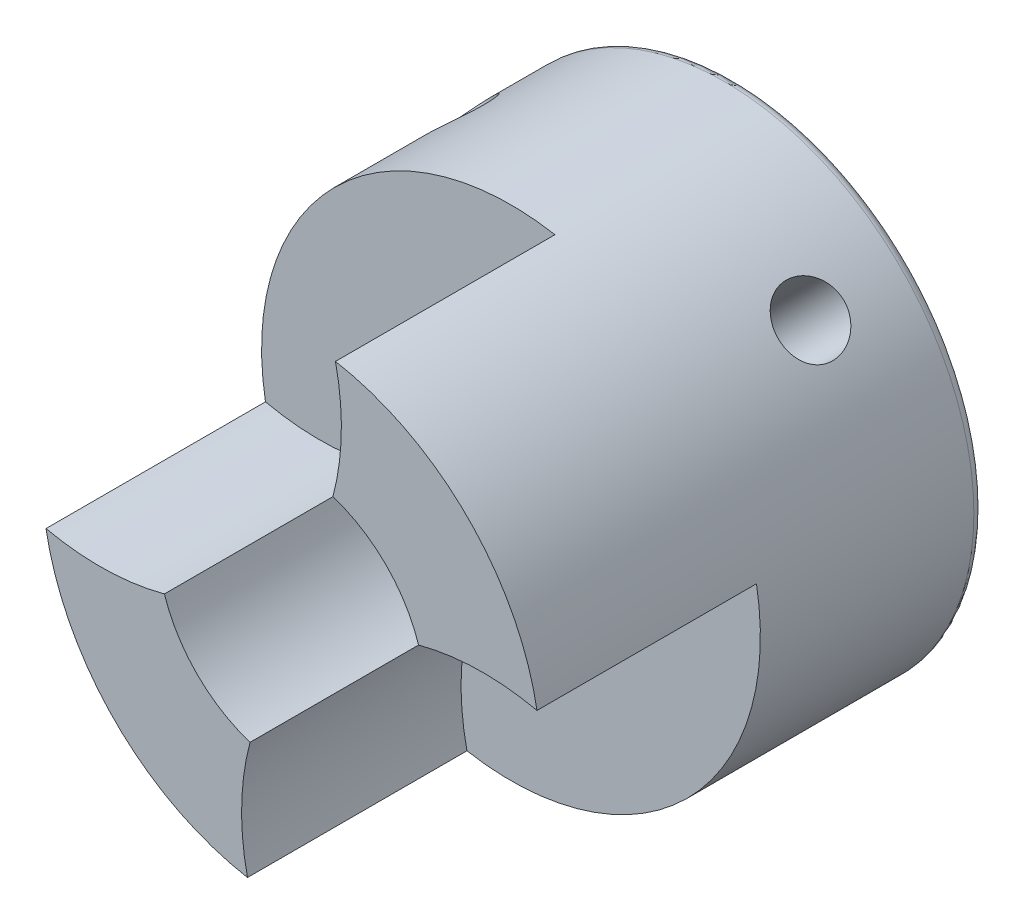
ISO-10303-21;
HEADER;
FILE_DESCRIPTION(('STEP AP214'),'2;1');
FILE_NAME('part.step','',(''),(''),'','','');
FILE_SCHEMA(('AUTOMOTIVE_DESIGN { 1 0 10303 214 1 1 1 1 }'));
ENDSEC;
DATA;
#1=APPLICATION_CONTEXT('core data for automotive mechanical design processes');
#2=APPLICATION_PROTOCOL_DEFINITION('international standard','automotive_design',2000,#1);
#3=PRODUCT_CONTEXT('',#1,'mechanical');
#4=PRODUCT('Part','Part','',(#3));
#5=PRODUCT_RELATED_PRODUCT_CATEGORY('part','',(#4));
#6=PRODUCT_DEFINITION_FORMATION('','',#4);
#7=PRODUCT_DEFINITION_CONTEXT('part definition',#1,'design');
#8=PRODUCT_DEFINITION('design','',#6,#7);
#9=PRODUCT_DEFINITION_SHAPE('','',#8);
#10=(LENGTH_UNIT() NAMED_UNIT(*) SI_UNIT(.MILLI.,.METRE.));
#11=(NAMED_UNIT(*) PLANE_ANGLE_UNIT() SI_UNIT($,.RADIAN.));
#12=(NAMED_UNIT(*) SI_UNIT($,.STERADIAN.) SOLID_ANGLE_UNIT());
#13=UNCERTAINTY_MEASURE_WITH_UNIT(LENGTH_MEASURE(1.E-05),#10,'distance_accuracy_value','');
#14=(GEOMETRIC_REPRESENTATION_CONTEXT(3) GLOBAL_UNCERTAINTY_ASSIGNED_CONTEXT((#13)) GLOBAL_UNIT_ASSIGNED_CONTEXT((#10,
#11,#12)) REPRESENTATION_CONTEXT('',''));
#15=CARTESIAN_POINT('',(0.,0.,0.));
#16=DIRECTION('',(0.,0.,1.));
#17=DIRECTION('',(1.,0.,0.));
#18=AXIS2_PLACEMENT_3D('',#15,#16,#17);
#19=CARTESIAN_POINT('',(0.,0.,22.2));
#20=DIRECTION('',(0.,0.,1.));
#21=DIRECTION('',(1.,0.,0.));
#22=AXIS2_PLACEMENT_3D('',#19,#20,#21);
#23=PLANE('',#22);
#24=CARTESIAN_POINT('',(9.6,-10.,22.2));
#25=DIRECTION('',(0.,0.,1.));
#26=DIRECTION('',(1.,0.,0.));
#27=AXIS2_PLACEMENT_3D('',#24,#25,#26);
#28=CIRCLE('',#27,12.5);
#29=CARTESIAN_POINT('',(12.3041620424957,2.20399556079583,22.2));
#30=VERTEX_POINT('',#29);
#31=CARTESIAN_POINT('',(6.37039730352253,2.0755814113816,22.2));
#32=VERTEX_POINT('',#31);
#33=EDGE_CURVE('E89',#30,#32,#28,.T.);
#34=ORIENTED_EDGE('',*,*,#33,.F.);
#35=CARTESIAN_POINT('',(0.,0.,22.2));
#36=DIRECTION('',(0.,0.,1.));
#37=DIRECTION('',(1.,0.,0.));
#38=AXIS2_PLACEMENT_3D('',#35,#36,#37);
#39=CIRCLE('',#38,12.5);
#40=CARTESIAN_POINT('',(2.20399556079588,12.3041620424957,22.2));
#41=VERTEX_POINT('',#40);
#42=EDGE_CURVE('E101',#30,#41,#39,.T.);
#43=ORIENTED_EDGE('',*,*,#42,.T.);
#44=CARTESIAN_POINT('',(-10.,9.6,22.2));
#45=DIRECTION('',(0.,0.,1.));
#46=DIRECTION('',(1.,0.,0.));
#47=AXIS2_PLACEMENT_3D('',#44,#45,#46);
#48=CIRCLE('',#47,12.5);
#49=CARTESIAN_POINT('',(2.07558141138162,6.37039730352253,22.2));
#50=VERTEX_POINT('',#49);
#51=EDGE_CURVE('E182',#50,#41,#48,.T.);
#52=ORIENTED_EDGE('',*,*,#51,.F.);
#53=CARTESIAN_POINT('',(0.,0.,22.2));
#54=DIRECTION('',(0.,0.,1.));
#55=DIRECTION('',(1.,0.,0.));
#56=AXIS2_PLACEMENT_3D('',#53,#54,#55);
#57=CIRCLE('',#56,6.7);
#58=EDGE_CURVE('E110',#32,#50,#57,.T.);
#59=ORIENTED_EDGE('',*,*,#58,.F.);
#60=EDGE_LOOP('',(#34,#43,#52,#59));
#61=FACE_BOUND('',#60,.T.);
#62=ADVANCED_FACE('F16',(#61),#23,.T.);
#63=CARTESIAN_POINT('',(0.,0.,11.2));
#64=DIRECTION('',(0.,0.,1.));
#65=DIRECTION('',(1.,0.,0.));
#66=AXIS2_PLACEMENT_3D('',#63,#64,#65);
#67=CYLINDRICAL_SURFACE('',#66,6.7);
#68=CARTESIAN_POINT('',(0.,0.,11.2));
#69=DIRECTION('',(0.,0.,1.));
#70=DIRECTION('',(1.,0.,0.));
#71=AXIS2_PLACEMENT_3D('',#68,#69,#70);
#72=CIRCLE('',#71,6.7);
#73=CARTESIAN_POINT('',(6.37039730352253,2.0755814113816,11.2));
#74=VERTEX_POINT('',#73);
#75=CARTESIAN_POINT('',(2.07558141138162,6.37039730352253,11.2));
#76=VERTEX_POINT('',#75);
#77=EDGE_CURVE('E102',#74,#76,#72,.T.);
#78=ORIENTED_EDGE('',*,*,#77,.F.);
#79=DIRECTION('',(0.,0.,1.));
#80=VECTOR('',#79,1.);
#81=CARTESIAN_POINT('',(6.37039730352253,2.0755814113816,11.2));
#82=LINE('',#81,#80);
#83=EDGE_CURVE('E173',#74,#32,#82,.T.);
#84=ORIENTED_EDGE('',*,*,#83,.T.);
#85=ORIENTED_EDGE('',*,*,#58,.T.);
#86=DIRECTION('',(0.,0.,1.));
#87=VECTOR('',#86,1.);
#88=CARTESIAN_POINT('',(2.07558141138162,6.37039730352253,11.2));
#89=LINE('',#88,#87);
#90=EDGE_CURVE('E193',#76,#50,#89,.T.);
#91=ORIENTED_EDGE('',*,*,#90,.F.);
#92=EDGE_LOOP('',(#78,#84,#85,#91));
#93=FACE_BOUND('',#92,.T.);
#94=ADVANCED_FACE('F142',(#93),#67,.F.);
#95=CARTESIAN_POINT('',(0.,0.,22.2));
#96=DIRECTION('',(0.,0.,-1.));
#97=DIRECTION('',(-1.,0.,0.));
#98=AXIS2_PLACEMENT_3D('',#95,#96,#97);
#99=CYLINDRICAL_SURFACE('',#98,12.5);
#100=CARTESIAN_POINT('',(7.59476626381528,9.92821864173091,5.));
#101=CARTESIAN_POINT('',(7.59477000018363,9.92821686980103,4.90775298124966));
#102=CARTESIAN_POINT('',(7.6009911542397,9.92346635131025,4.81544938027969));
#103=CARTESIAN_POINT('',(7.62564773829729,9.9045307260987,4.63341410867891));
#104=CARTESIAN_POINT('',(7.64409570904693,9.89033593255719,4.54368517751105));
#105=CARTESIAN_POINT('',(7.69246949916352,9.85275824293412,4.36946099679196));
#106=CARTESIAN_POINT('',(7.72238726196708,9.82938179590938,4.28496212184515));
#107=CARTESIAN_POINT('',(7.79255877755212,9.77384368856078,4.12350227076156));
#108=CARTESIAN_POINT('',(7.83281085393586,9.74168345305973,4.04654007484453));
#109=CARTESIAN_POINT('',(7.92243681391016,9.66893660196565,3.90184431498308));
#110=CARTESIAN_POINT('',(7.97186019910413,9.62830410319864,3.83416447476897));
#111=CARTESIAN_POINT('',(8.07793633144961,9.53948218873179,3.71041907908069));
#112=CARTESIAN_POINT('',(8.13458944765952,9.49129238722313,3.65435411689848));
#113=CARTESIAN_POINT('',(8.25341894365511,9.38814566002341,3.55523565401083));
#114=CARTESIAN_POINT('',(8.31561496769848,9.33316437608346,3.51223102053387));
#115=CARTESIAN_POINT('',(8.44328962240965,9.2178225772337,3.44076710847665));
#116=CARTESIAN_POINT('',(8.50876811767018,9.157462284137,3.41230723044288));
#117=CARTESIAN_POINT('',(8.64053119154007,9.03323680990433,3.37090189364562));
#118=CARTESIAN_POINT('',(8.70680884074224,8.96939412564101,3.35786691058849));
#119=CARTESIAN_POINT('',(8.83853807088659,8.83961487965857,3.34740379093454));
#120=CARTESIAN_POINT('',(8.90398968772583,8.77367840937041,3.34997497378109));
#121=CARTESIAN_POINT('',(9.03180462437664,8.64204100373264,3.37057974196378));
#122=CARTESIAN_POINT('',(9.09418462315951,8.57634115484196,3.38851703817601));
#123=CARTESIAN_POINT('',(9.21466922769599,8.44675699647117,3.43919417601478));
#124=CARTESIAN_POINT('',(9.27277374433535,8.38287272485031,3.47193432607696));
#125=CARTESIAN_POINT('',(9.38349492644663,8.25875097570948,3.55138918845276));
#126=CARTESIAN_POINT('',(9.43609471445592,8.19852493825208,3.59814527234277));
#127=CARTESIAN_POINT('',(9.53447683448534,8.08390163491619,3.70427464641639));
#128=CARTESIAN_POINT('',(9.58025881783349,8.02950466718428,3.7636485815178));
#129=CARTESIAN_POINT('',(9.66442672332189,7.92800387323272,3.8938668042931));
#130=CARTESIAN_POINT('',(9.70275362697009,7.88095878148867,3.96479505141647));
#131=CARTESIAN_POINT('',(9.7708651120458,7.7963551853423,4.11582092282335));
#132=CARTESIAN_POINT('',(9.80064966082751,7.7587967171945,4.1959185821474));
#133=CARTESIAN_POINT('',(9.85116537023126,7.69455780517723,4.36308708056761));
#134=CARTESIAN_POINT('',(9.87189192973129,7.66788289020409,4.45016143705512));
#135=CARTESIAN_POINT('',(9.90391040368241,7.62648346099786,4.62877082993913));
#136=CARTESIAN_POINT('',(9.91520282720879,7.61175830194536,4.72030562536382));
#137=CARTESIAN_POINT('',(9.92811193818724,7.59491323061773,4.90450075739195));
#138=CARTESIAN_POINT('',(9.92980072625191,7.59269938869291,4.99714745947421));
#139=CARTESIAN_POINT('',(9.92366736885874,7.60071380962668,5.18158188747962));
#140=CARTESIAN_POINT('',(9.91584545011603,7.61094177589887,5.27336963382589));
#141=CARTESIAN_POINT('',(9.89087137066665,7.64336806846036,5.45312570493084));
#142=CARTESIAN_POINT('',(9.87375468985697,7.665520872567,5.54110718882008));
#143=CARTESIAN_POINT('',(9.83050244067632,7.72090986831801,5.71116579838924));
#144=CARTESIAN_POINT('',(9.80436652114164,7.75414649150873,5.79324269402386));
#145=CARTESIAN_POINT('',(9.74334159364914,7.83068932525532,5.94969214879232));
#146=CARTESIAN_POINT('',(9.70840207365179,7.87405353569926,6.02401662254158));
#147=CARTESIAN_POINT('',(9.63047143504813,7.969177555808,6.16235984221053));
#148=CARTESIAN_POINT('',(9.58747996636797,8.02093773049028,6.22637813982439));
#149=CARTESIAN_POINT('',(9.49396651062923,8.13141195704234,6.34270658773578));
#150=CARTESIAN_POINT('',(9.44339822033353,8.19016827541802,6.39493941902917));
#151=CARTESIAN_POINT('',(9.33600533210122,8.31237705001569,6.48567827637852));
#152=CARTESIAN_POINT('',(9.27918087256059,8.37582940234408,6.52418460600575));
#153=CARTESIAN_POINT('',(9.16077921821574,8.50516203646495,6.58625080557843));
#154=CARTESIAN_POINT('',(9.09921663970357,8.57103454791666,6.60985472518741));
#155=CARTESIAN_POINT('',(8.97277204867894,8.70331709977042,6.64158919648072));
#156=CARTESIAN_POINT('',(8.90789020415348,8.76972711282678,6.64972053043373));
#157=CARTESIAN_POINT('',(8.77711688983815,8.90060181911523,6.65026322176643));
#158=CARTESIAN_POINT('',(8.71123683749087,8.96507745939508,6.6427935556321));
#159=CARTESIAN_POINT('',(8.57992334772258,9.09082959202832,6.61259906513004));
#160=CARTESIAN_POINT('',(8.51448990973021,9.15210608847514,6.58987426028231));
#161=CARTESIAN_POINT('',(8.38611474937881,9.26987974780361,6.5298532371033));
#162=CARTESIAN_POINT('',(8.32317195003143,9.3263789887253,6.49256339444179));
#163=CARTESIAN_POINT('',(8.20175754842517,9.43333063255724,6.40448318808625));
#164=CARTESIAN_POINT('',(8.14328602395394,9.48378293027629,6.35369258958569));
#165=CARTESIAN_POINT('',(8.03234168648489,9.57793442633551,6.23961489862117));
#166=CARTESIAN_POINT('',(7.97991570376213,9.6215817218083,6.17623941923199));
#167=CARTESIAN_POINT('',(7.88337086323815,9.70084409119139,6.03897565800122));
#168=CARTESIAN_POINT('',(7.83925396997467,9.73645726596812,5.96508489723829));
#169=CARTESIAN_POINT('',(7.7607716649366,9.79913078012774,5.80852002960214));
#170=CARTESIAN_POINT('',(7.72644906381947,9.82615362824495,5.72580946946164));
#171=CARTESIAN_POINT('',(7.66914907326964,9.870941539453,5.55425368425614));
#172=CARTESIAN_POINT('',(7.64615949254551,9.88871655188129,5.46541516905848));
#173=CARTESIAN_POINT('',(7.61783817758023,9.91053678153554,5.31344333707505));
#174=CARTESIAN_POINT('',(7.60920249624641,9.9171614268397,5.25126378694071));
#175=CARTESIAN_POINT('',(7.59766528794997,9.92600294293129,5.12606496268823));
#176=CARTESIAN_POINT('',(7.59476371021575,9.92821985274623,5.06304569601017));
#177=CARTESIAN_POINT('',(7.59476626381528,9.92821864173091,5.));
#178=B_SPLINE_CURVE_WITH_KNOTS('',3,(#100,#101,#102,#103,#104,#105,#106,#107,#108,#109,#110,
#111,#112,#113,#114,#115,#116,#117,#118,#119,#120,#121,#122,#123,#124,#125,#126,#127,#128,#129,
#130,#131,#132,#133,#134,#135,#136,#137,#138,#139,#140,#141,#142,#143,#144,#145,#146,#147,#148,
#149,#150,#151,#152,#153,#154,#155,#156,#157,#158,#159,#160,#161,#162,#163,#164,#165,#166,#167,
#168,#169,#170,#171,#172,#173,#174,#175,#176,#177),.UNSPECIFIED.,.T.,.F.,(4,2,2,2,2,2,2,2,2,2,2,
2,2,2,2,2,2,2,2,2,2,2,2,2,2,2,2,2,2,2,2,2,2,2,2,2,2,2,4),(0.,0.27651070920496,0.55330546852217,
0.829906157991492,1.10646200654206,1.38455642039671,1.66266503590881,1.94180176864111,
2.22092699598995,2.49842414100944,2.77590918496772,3.05166803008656,3.32743262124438,
3.60401935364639,3.88062022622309,4.15932887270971,4.4380385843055,4.71688970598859,
4.99572577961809,5.27246566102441,5.54919894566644,5.82488323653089,6.10057826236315,
6.37789266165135,6.65521912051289,6.93431525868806,7.21340522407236,7.49166632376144,
7.76991335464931,8.04604616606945,8.32217862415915,8.59819034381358,8.87420686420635,
9.15223523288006,9.43032925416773,9.70962082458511,9.9886112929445,10.1775926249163,
10.3665722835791),.UNSPECIFIED.);
#179=CARTESIAN_POINT('',(7.59476626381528,9.92821864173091,5.));
#180=VERTEX_POINT('',#179);
#181=EDGE_CURVE('E355',#180,#180,#178,.T.);
#182=ORIENTED_EDGE('',*,*,#181,.T.);
#183=EDGE_LOOP('',(#182));
#184=FACE_BOUND('',#183,.T.);
#185=CARTESIAN_POINT('',(-9.92821864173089,7.59476626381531,5.));
#186=CARTESIAN_POINT('',(-9.92821686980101,7.59477000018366,4.90775298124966));
#187=CARTESIAN_POINT('',(-9.92346635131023,7.60099115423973,4.81544938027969));
#188=CARTESIAN_POINT('',(-9.90453072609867,7.62564773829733,4.63341410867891));
#189=CARTESIAN_POINT('',(-9.89033593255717,7.64409570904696,4.54368517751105));
#190=CARTESIAN_POINT('',(-9.8527582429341,7.69246949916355,4.36946099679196));
#191=CARTESIAN_POINT('',(-9.82938179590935,7.72238726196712,4.28496212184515));
#192=CARTESIAN_POINT('',(-9.77384368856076,7.79255877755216,4.12350227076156));
#193=CARTESIAN_POINT('',(-9.74168345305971,7.83281085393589,4.04654007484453));
#194=CARTESIAN_POINT('',(-9.66893660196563,7.92243681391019,3.90184431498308));
#195=CARTESIAN_POINT('',(-9.62830410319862,7.97186019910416,3.83416447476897));
#196=CARTESIAN_POINT('',(-9.53948218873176,8.07793633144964,3.71041907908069));
#197=CARTESIAN_POINT('',(-9.4912923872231,8.13458944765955,3.65435411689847));
#198=CARTESIAN_POINT('',(-9.38814566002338,8.25341894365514,3.55523565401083));
#199=CARTESIAN_POINT('',(-9.33316437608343,8.31561496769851,3.51223102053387));
#200=CARTESIAN_POINT('',(-9.21782257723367,8.44328962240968,3.44076710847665));
#201=CARTESIAN_POINT('',(-9.15746228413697,8.50876811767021,3.41230723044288));
#202=CARTESIAN_POINT('',(-9.03323680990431,8.6405311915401,3.37090189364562));
#203=CARTESIAN_POINT('',(-8.96939412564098,8.70680884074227,3.35786691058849));
#204=CARTESIAN_POINT('',(-8.83961487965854,8.83853807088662,3.34740379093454));
#205=CARTESIAN_POINT('',(-8.77367840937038,8.90398968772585,3.34997497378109));
#206=CARTESIAN_POINT('',(-8.64204100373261,9.03180462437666,3.37057974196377));
#207=CARTESIAN_POINT('',(-8.57634115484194,9.09418462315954,3.38851703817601));
#208=CARTESIAN_POINT('',(-8.44675699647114,9.21466922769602,3.43919417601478));
#209=CARTESIAN_POINT('',(-8.38287272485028,9.27277374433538,3.47193432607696));
#210=CARTESIAN_POINT('',(-8.25875097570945,9.38349492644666,3.55138918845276));
#211=CARTESIAN_POINT('',(-8.19852493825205,9.43609471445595,3.59814527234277));
#212=CARTESIAN_POINT('',(-8.08390163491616,9.53447683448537,3.70427464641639));
#213=CARTESIAN_POINT('',(-8.02950466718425,9.58025881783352,3.76364858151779));
#214=CARTESIAN_POINT('',(-7.92800387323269,9.66442672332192,3.8938668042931));
#215=CARTESIAN_POINT('',(-7.88095878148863,9.70275362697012,3.96479505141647));
#216=CARTESIAN_POINT('',(-7.79635518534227,9.77086511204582,4.11582092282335));
#217=CARTESIAN_POINT('',(-7.75879671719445,9.80064966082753,4.1959185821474));
#218=CARTESIAN_POINT('',(-7.69455780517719,9.85116537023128,4.36308708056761));
#219=CARTESIAN_POINT('',(-7.66788289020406,9.87189192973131,4.45016143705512));
#220=CARTESIAN_POINT('',(-7.62648346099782,9.90391040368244,4.62877082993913));
#221=CARTESIAN_POINT('',(-7.61175830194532,9.91520282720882,4.72030562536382));
#222=CARTESIAN_POINT('',(-7.59491323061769,9.92811193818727,4.90450075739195));
#223=CARTESIAN_POINT('',(-7.59269938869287,9.92980072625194,4.99714745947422));
#224=CARTESIAN_POINT('',(-7.60071380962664,9.92366736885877,5.18158188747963));
#225=CARTESIAN_POINT('',(-7.61094177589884,9.91584545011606,5.2733696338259));
#226=CARTESIAN_POINT('',(-7.64336806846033,9.89087137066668,5.45312570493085));
#227=CARTESIAN_POINT('',(-7.66552087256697,9.873754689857,5.54110718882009));
#228=CARTESIAN_POINT('',(-7.72090986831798,9.83050244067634,5.71116579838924));
#229=CARTESIAN_POINT('',(-7.75414649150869,9.80436652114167,5.79324269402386));
#230=CARTESIAN_POINT('',(-7.83068932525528,9.74334159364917,5.94969214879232));
#231=CARTESIAN_POINT('',(-7.87405353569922,9.70840207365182,6.02401662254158));
#232=CARTESIAN_POINT('',(-7.96917755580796,9.63047143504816,6.16235984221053));
#233=CARTESIAN_POINT('',(-8.02093773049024,9.58747996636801,6.22637813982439));
#234=CARTESIAN_POINT('',(-8.1314119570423,9.49396651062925,6.34270658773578));
#235=CARTESIAN_POINT('',(-8.19016827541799,9.44339822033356,6.39493941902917));
#236=CARTESIAN_POINT('',(-8.31237705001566,9.33600533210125,6.48567827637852));
#237=CARTESIAN_POINT('',(-8.37582940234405,9.27918087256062,6.52418460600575));
#238=CARTESIAN_POINT('',(-8.50516203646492,9.16077921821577,6.58625080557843));
#239=CARTESIAN_POINT('',(-8.57103454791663,9.0992166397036,6.60985472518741));
#240=CARTESIAN_POINT('',(-8.70331709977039,8.97277204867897,6.64158919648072));
#241=CARTESIAN_POINT('',(-8.76972711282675,8.90789020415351,6.64972053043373));
#242=CARTESIAN_POINT('',(-8.9006018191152,8.77711688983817,6.65026322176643));
#243=CARTESIAN_POINT('',(-8.96507745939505,8.71123683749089,6.6427935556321));
#244=CARTESIAN_POINT('',(-9.0908295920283,8.57992334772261,6.61259906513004));
#245=CARTESIAN_POINT('',(-9.15210608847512,8.51448990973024,6.58987426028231));
#246=CARTESIAN_POINT('',(-9.26987974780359,8.38611474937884,6.5298532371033));
#247=CARTESIAN_POINT('',(-9.32637898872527,8.32317195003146,6.49256339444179));
#248=CARTESIAN_POINT('',(-9.43333063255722,8.2017575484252,6.40448318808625));
#249=CARTESIAN_POINT('',(-9.48378293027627,8.14328602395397,6.35369258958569));
#250=CARTESIAN_POINT('',(-9.57793442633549,8.03234168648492,6.23961489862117));
#251=CARTESIAN_POINT('',(-9.62158172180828,7.97991570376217,6.17623941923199));
#252=CARTESIAN_POINT('',(-9.70084409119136,7.88337086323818,6.03897565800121));
#253=CARTESIAN_POINT('',(-9.73645726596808,7.83925396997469,5.96508489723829));
#254=CARTESIAN_POINT('',(-9.7991307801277,7.76077166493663,5.80852002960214));
#255=CARTESIAN_POINT('',(-9.82615362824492,7.7264490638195,5.72580946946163));
#256=CARTESIAN_POINT('',(-9.87094153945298,7.66914907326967,5.55425368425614));
#257=CARTESIAN_POINT('',(-9.88871655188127,7.64615949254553,5.46541516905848));
#258=CARTESIAN_POINT('',(-9.91053678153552,7.61783817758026,5.31344333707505));
#259=CARTESIAN_POINT('',(-9.91716142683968,7.60920249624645,5.25126378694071));
#260=CARTESIAN_POINT('',(-9.92600294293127,7.59766528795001,5.12606496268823));
#261=CARTESIAN_POINT('',(-9.92821985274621,7.59476371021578,5.06304569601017));
#262=CARTESIAN_POINT('',(-9.92821864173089,7.59476626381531,5.));
#263=B_SPLINE_CURVE_WITH_KNOTS('',3,(#185,#186,#187,#188,#189,#190,#191,#192,#193,#194,#195,
#196,#197,#198,#199,#200,#201,#202,#203,#204,#205,#206,#207,#208,#209,#210,#211,#212,#213,#214,
#215,#216,#217,#218,#219,#220,#221,#222,#223,#224,#225,#226,#227,#228,#229,#230,#231,#232,#233,
#234,#235,#236,#237,#238,#239,#240,#241,#242,#243,#244,#245,#246,#247,#248,#249,#250,#251,#252,
#253,#254,#255,#256,#257,#258,#259,#260,#261,#262),.UNSPECIFIED.,.T.,.F.,(4,2,2,2,2,2,2,2,2,2,2,
2,2,2,2,2,2,2,2,2,2,2,2,2,2,2,2,2,2,2,2,2,2,2,2,2,2,2,4),(0.,0.27651070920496,0.553305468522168,
0.829906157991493,1.10646200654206,1.38455642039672,1.66266503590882,1.94180176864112,
2.22092699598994,2.49842414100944,2.77590918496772,3.05166803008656,3.32743262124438,
3.6040193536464,3.88062022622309,4.15932887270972,4.43803858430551,4.7168897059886,
4.9957257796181,5.27246566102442,5.54919894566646,5.82488323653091,6.10057826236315,
6.37789266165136,6.65521912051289,6.93431525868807,7.21340522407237,7.49166632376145,
7.76991335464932,8.04604616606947,8.32217862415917,8.5981903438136,8.87420686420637,
9.15223523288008,9.43032925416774,9.70962082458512,9.98861129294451,10.1775926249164,
10.3665722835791),.UNSPECIFIED.);
#264=CARTESIAN_POINT('',(-9.92821864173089,7.59476626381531,5.));
#265=VERTEX_POINT('',#264);
#266=EDGE_CURVE('E118',#265,#265,#263,.T.);
#267=ORIENTED_EDGE('',*,*,#266,.T.);
#268=EDGE_LOOP('',(#267));
#269=FACE_BOUND('',#268,.T.);
#270=CARTESIAN_POINT('',(0.,0.,0.5));
#271=DIRECTION('',(0.,0.,1.));
#272=DIRECTION('',(1.,0.,0.));
#273=AXIS2_PLACEMENT_3D('',#270,#271,#272);
#274=CIRCLE('',#273,12.5);
#275=CARTESIAN_POINT('',(12.5,0.,0.5));
#276=VERTEX_POINT('',#275);
#277=EDGE_CURVE('E113',#276,#276,#274,.T.);
#278=ORIENTED_EDGE('',*,*,#277,.T.);
#279=EDGE_LOOP('',(#278));
#280=FACE_BOUND('',#279,.T.);
#281=ORIENTED_EDGE('',*,*,#42,.F.);
#282=DIRECTION('',(0.,0.,1.));
#283=VECTOR('',#282,1.);
#284=CARTESIAN_POINT('',(12.3041620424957,2.20399556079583,11.2));
#285=LINE('',#284,#283);
#286=CARTESIAN_POINT('',(12.3041620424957,2.20399556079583,11.2));
#287=VERTEX_POINT('',#286);
#288=EDGE_CURVE('E177',#287,#30,#285,.T.);
#289=ORIENTED_EDGE('',*,*,#288,.F.);
#290=CARTESIAN_POINT('',(0.,0.,11.2));
#291=DIRECTION('',(0.,0.,1.));
#292=DIRECTION('',(1.,0.,0.));
#293=AXIS2_PLACEMENT_3D('',#290,#291,#292);
#294=CIRCLE('',#293,12.5);
#295=CARTESIAN_POINT('',(-2.20650931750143,-12.3037114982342,11.2));
#296=VERTEX_POINT('',#295);
#297=EDGE_CURVE('E88',#296,#287,#294,.T.);
#298=ORIENTED_EDGE('',*,*,#297,.F.);
#299=DIRECTION('',(0.,0.,1.));
#300=VECTOR('',#299,1.);
#301=CARTESIAN_POINT('',(-2.20650931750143,-12.3037114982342,11.2));
#302=LINE('',#301,#300);
#303=CARTESIAN_POINT('',(-2.20650931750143,-12.3037114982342,22.2));
#304=VERTEX_POINT('',#303);
#305=EDGE_CURVE('E86',#296,#304,#302,.T.);
#306=ORIENTED_EDGE('',*,*,#305,.T.);
#307=CARTESIAN_POINT('',(-12.3041620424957,-2.20399556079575,22.2));
#308=VERTEX_POINT('',#307);
#309=EDGE_CURVE('E104',#308,#304,#39,.T.);
#310=ORIENTED_EDGE('',*,*,#309,.F.);
#311=DIRECTION('',(0.,0.,1.));
#312=VECTOR('',#311,1.);
#313=CARTESIAN_POINT('',(-12.3041620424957,-2.20399556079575,11.2));
#314=LINE('',#313,#312);
#315=CARTESIAN_POINT('',(-12.3041620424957,-2.20399556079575,11.2));
#316=VERTEX_POINT('',#315);
#317=EDGE_CURVE('E108',#316,#308,#314,.T.);
#318=ORIENTED_EDGE('',*,*,#317,.F.);
#319=CARTESIAN_POINT('',(0.,0.,11.2));
#320=DIRECTION('',(0.,0.,1.));
#321=DIRECTION('',(1.,0.,0.));
#322=AXIS2_PLACEMENT_3D('',#319,#320,#321);
#323=CIRCLE('',#322,12.5);
#324=CARTESIAN_POINT('',(2.20399556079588,12.3041620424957,11.2));
#325=VERTEX_POINT('',#324);
#326=EDGE_CURVE('E180',#325,#316,#323,.T.);
#327=ORIENTED_EDGE('',*,*,#326,.F.);
#328=DIRECTION('',(0.,0.,1.));
#329=VECTOR('',#328,1.);
#330=CARTESIAN_POINT('',(2.20399556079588,12.3041620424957,11.2));
#331=LINE('',#330,#329);
#332=EDGE_CURVE('E190',#325,#41,#331,.T.);
#333=ORIENTED_EDGE('',*,*,#332,.T.);
#334=EDGE_LOOP('',(#281,#289,#298,#306,#310,#318,#327,#333));
#335=FACE_BOUND('',#334,.T.);
#336=ADVANCED_FACE('F150',(#184,#269,#280,#335),#99,.T.);
#337=CARTESIAN_POINT('',(9.99748641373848,-9.59955022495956,22.2));
#338=DIRECTION('',(0.,0.,1.));
#339=DIRECTION('',(1.,0.,0.));
#340=AXIS2_PLACEMENT_3D('',#337,#338,#339);
#341=CIRCLE('',#340,12.5);
#342=CARTESIAN_POINT('',(-2.07800404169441,-6.36960746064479,22.2));
#343=VERTEX_POINT('',#342);
#344=EDGE_CURVE('E117',#343,#304,#341,.T.);
#345=ORIENTED_EDGE('',*,*,#344,.F.);
#346=CARTESIAN_POINT('',(-6.37039730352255,-2.07558141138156,22.2));
#347=VERTEX_POINT('',#346);
#348=EDGE_CURVE('E98',#347,#343,#57,.T.);
#349=ORIENTED_EDGE('',*,*,#348,.F.);
#350=CARTESIAN_POINT('',(-9.6,10.,22.2));
#351=DIRECTION('',(0.,0.,1.));
#352=DIRECTION('',(1.,0.,0.));
#353=AXIS2_PLACEMENT_3D('',#350,#351,#352);
#354=CIRCLE('',#353,12.5);
#355=EDGE_CURVE('E176',#308,#347,#354,.T.);
#356=ORIENTED_EDGE('',*,*,#355,.F.);
#357=ORIENTED_EDGE('',*,*,#309,.T.);
#358=EDGE_LOOP('',(#345,#349,#356,#357));
#359=FACE_BOUND('',#358,.T.);
#360=ADVANCED_FACE('F145',(#359),#23,.T.);
#361=CARTESIAN_POINT('',(0.,0.,0.));
#362=DIRECTION('',(0.,0.,1.));
#363=DIRECTION('',(1.,0.,0.));
#364=AXIS2_PLACEMENT_3D('',#361,#362,#363);
#365=PLANE('',#364);
#366=CARTESIAN_POINT('',(0.,0.,0.));
#367=DIRECTION('',(0.,0.,1.));
#368=DIRECTION('',(1.,0.,0.));
#369=AXIS2_PLACEMENT_3D('',#366,#367,#368);
#370=CIRCLE('',#369,4.2);
#371=CARTESIAN_POINT('',(4.2,0.,0.));
#372=VERTEX_POINT('',#371);
#373=EDGE_CURVE('E10',#372,#372,#370,.T.);
#374=ORIENTED_EDGE('',*,*,#373,.T.);
#375=EDGE_LOOP('',(#374));
#376=FACE_BOUND('',#375,.T.);
#377=CARTESIAN_POINT('',(0.,0.,0.));
#378=DIRECTION('',(0.,0.,1.));
#379=DIRECTION('',(1.,0.,0.));
#380=AXIS2_PLACEMENT_3D('',#377,#378,#379);
#381=CIRCLE('',#380,12.);
#382=CARTESIAN_POINT('',(12.,0.,0.));
#383=VERTEX_POINT('',#382);
#384=EDGE_CURVE('E121',#383,#383,#381,.F.);
#385=ORIENTED_EDGE('',*,*,#384,.T.);
#386=EDGE_LOOP('',(#385));
#387=FACE_BOUND('',#386,.T.);
#388=ADVANCED_FACE('F156',(#376,#387),#365,.F.);
#389=ORIENTED_EDGE('',*,*,#348,.T.);
#390=DIRECTION('',(0.,0.,1.));
#391=VECTOR('',#390,1.);
#392=CARTESIAN_POINT('',(-2.07800404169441,-6.36960746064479,11.2));
#393=LINE('',#392,#391);
#394=CARTESIAN_POINT('',(-2.07800404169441,-6.36960746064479,11.2));
#395=VERTEX_POINT('',#394);
#396=EDGE_CURVE('E83',#395,#343,#393,.T.);
#397=ORIENTED_EDGE('',*,*,#396,.F.);
#398=CARTESIAN_POINT('',(-6.37039730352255,-2.07558141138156,11.2));
#399=VERTEX_POINT('',#398);
#400=EDGE_CURVE('E96',#399,#395,#72,.T.);
#401=ORIENTED_EDGE('',*,*,#400,.F.);
#402=DIRECTION('',(0.,0.,1.));
#403=VECTOR('',#402,1.);
#404=CARTESIAN_POINT('',(-6.37039730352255,-2.07558141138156,11.2));
#405=LINE('',#404,#403);
#406=EDGE_CURVE('E195',#399,#347,#405,.T.);
#407=ORIENTED_EDGE('',*,*,#406,.T.);
#408=EDGE_LOOP('',(#389,#397,#401,#407));
#409=FACE_BOUND('',#408,.T.);
#410=ADVANCED_FACE('F94',(#409),#67,.F.);
#411=CARTESIAN_POINT('',(0.,0.,11.2));
#412=DIRECTION('',(0.,0.,1.));
#413=DIRECTION('',(1.,0.,0.));
#414=AXIS2_PLACEMENT_3D('',#411,#412,#413);
#415=PLANE('',#414);
#416=CARTESIAN_POINT('',(0.,0.,11.2));
#417=DIRECTION('',(0.,0.,1.));
#418=DIRECTION('',(1.,0.,0.));
#419=AXIS2_PLACEMENT_3D('',#416,#417,#418);
#420=CIRCLE('',#419,4.);
#421=CARTESIAN_POINT('',(4.,0.,11.2));
#422=VERTEX_POINT('',#421);
#423=EDGE_CURVE('E114',#422,#422,#420,.T.);
#424=ORIENTED_EDGE('',*,*,#423,.F.);
#425=EDGE_LOOP('',(#424));
#426=FACE_BOUND('',#425,.T.);
#427=ORIENTED_EDGE('',*,*,#400,.T.);
#428=CARTESIAN_POINT('',(9.99748641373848,-9.59955022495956,11.2));
#429=DIRECTION('',(0.,0.,1.));
#430=DIRECTION('',(1.,0.,0.));
#431=AXIS2_PLACEMENT_3D('',#428,#429,#430);
#432=CIRCLE('',#431,12.5);
#433=EDGE_CURVE('E80',#395,#296,#432,.T.);
#434=ORIENTED_EDGE('',*,*,#433,.T.);
#435=ORIENTED_EDGE('',*,*,#297,.T.);
#436=CARTESIAN_POINT('',(9.6,-10.,11.2));
#437=DIRECTION('',(0.,0.,1.));
#438=DIRECTION('',(1.,0.,0.));
#439=AXIS2_PLACEMENT_3D('',#436,#437,#438);
#440=CIRCLE('',#439,12.5);
#441=EDGE_CURVE('E31',#287,#74,#440,.T.);
#442=ORIENTED_EDGE('',*,*,#441,.T.);
#443=ORIENTED_EDGE('',*,*,#77,.T.);
#444=CARTESIAN_POINT('',(-10.,9.6,11.2));
#445=DIRECTION('',(0.,0.,1.));
#446=DIRECTION('',(1.,0.,0.));
#447=AXIS2_PLACEMENT_3D('',#444,#445,#446);
#448=CIRCLE('',#447,12.5);
#449=EDGE_CURVE('E184',#76,#325,#448,.T.);
#450=ORIENTED_EDGE('',*,*,#449,.T.);
#451=ORIENTED_EDGE('',*,*,#326,.T.);
#452=CARTESIAN_POINT('',(-9.6,10.,11.2));
#453=DIRECTION('',(0.,0.,1.));
#454=DIRECTION('',(1.,0.,0.));
#455=AXIS2_PLACEMENT_3D('',#452,#453,#454);
#456=CIRCLE('',#455,12.5);
#457=EDGE_CURVE('E38',#316,#399,#456,.T.);
#458=ORIENTED_EDGE('',*,*,#457,.T.);
#459=EDGE_LOOP('',(#427,#434,#435,#442,#443,#450,#451,#458));
#460=FACE_BOUND('',#459,.T.);
#461=ADVANCED_FACE('F100',(#426,#460),#415,.T.);
#462=CARTESIAN_POINT('',(-10.,9.6,11.2));
#463=DIRECTION('',(0.,0.,1.));
#464=DIRECTION('',(1.,0.,0.));
#465=AXIS2_PLACEMENT_3D('',#462,#463,#464);
#466=CYLINDRICAL_SURFACE('',#465,12.5);
#467=ORIENTED_EDGE('',*,*,#51,.T.);
#468=ORIENTED_EDGE('',*,*,#332,.F.);
#469=ORIENTED_EDGE('',*,*,#449,.F.);
#470=ORIENTED_EDGE('',*,*,#90,.T.);
#471=EDGE_LOOP('',(#467,#468,#469,#470));
#472=FACE_BOUND('',#471,.T.);
#473=ADVANCED_FACE('F232',(#472),#466,.F.);
#474=CARTESIAN_POINT('',(-9.6,10.,11.2));
#475=DIRECTION('',(0.,0.,1.));
#476=DIRECTION('',(1.,0.,0.));
#477=AXIS2_PLACEMENT_3D('',#474,#475,#476);
#478=CYLINDRICAL_SURFACE('',#477,12.5);
#479=ORIENTED_EDGE('',*,*,#355,.T.);
#480=ORIENTED_EDGE('',*,*,#406,.F.);
#481=ORIENTED_EDGE('',*,*,#457,.F.);
#482=ORIENTED_EDGE('',*,*,#317,.T.);
#483=EDGE_LOOP('',(#479,#480,#481,#482));
#484=FACE_BOUND('',#483,.T.);
#485=ADVANCED_FACE('F198',(#484),#478,.F.);
#486=CARTESIAN_POINT('',(9.6,-10.,11.2));
#487=DIRECTION('',(0.,0.,1.));
#488=DIRECTION('',(1.,0.,0.));
#489=AXIS2_PLACEMENT_3D('',#486,#487,#488);
#490=CYLINDRICAL_SURFACE('',#489,12.5);
#491=ORIENTED_EDGE('',*,*,#33,.T.);
#492=ORIENTED_EDGE('',*,*,#83,.F.);
#493=ORIENTED_EDGE('',*,*,#441,.F.);
#494=ORIENTED_EDGE('',*,*,#288,.T.);
#495=EDGE_LOOP('',(#491,#492,#493,#494));
#496=FACE_BOUND('',#495,.T.);
#497=ADVANCED_FACE('F226',(#496),#490,.F.);
#498=CARTESIAN_POINT('',(9.99748641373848,-9.59955022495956,11.2));
#499=DIRECTION('',(0.,0.,1.));
#500=DIRECTION('',(1.,0.,0.));
#501=AXIS2_PLACEMENT_3D('',#498,#499,#500);
#502=CYLINDRICAL_SURFACE('',#501,12.5);
#503=ORIENTED_EDGE('',*,*,#344,.T.);
#504=ORIENTED_EDGE('',*,*,#305,.F.);
#505=ORIENTED_EDGE('',*,*,#433,.F.);
#506=ORIENTED_EDGE('',*,*,#396,.T.);
#507=EDGE_LOOP('',(#503,#504,#505,#506));
#508=FACE_BOUND('',#507,.T.);
#509=ADVANCED_FACE('F82',(#508),#502,.F.);
#510=CARTESIAN_POINT('',(0.,0.,22.2));
#511=DIRECTION('',(0.,0.,-1.));
#512=DIRECTION('',(-1.,0.,0.));
#513=AXIS2_PLACEMENT_3D('',#510,#511,#512);
#514=CYLINDRICAL_SURFACE('',#513,4.);
#515=CARTESIAN_POINT('',(0.,0.,0.2));
#516=DIRECTION('',(0.,0.,1.));
#517=DIRECTION('',(1.,0.,0.));
#518=AXIS2_PLACEMENT_3D('',#515,#516,#517);
#519=CIRCLE('',#518,4.);
#520=CARTESIAN_POINT('',(4.,0.,0.2));
#521=VERTEX_POINT('',#520);
#522=EDGE_CURVE('E24',#521,#521,#519,.F.);
#523=ORIENTED_EDGE('',*,*,#522,.T.);
#524=EDGE_LOOP('',(#523));
#525=FACE_BOUND('',#524,.T.);
#526=CARTESIAN_POINT('',(1.40985099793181,3.74330337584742,5.));
#527=CARTESIAN_POINT('',(1.40986406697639,3.74330310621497,5.08809648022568));
#528=CARTESIAN_POINT('',(1.41716349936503,3.74057480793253,5.17634043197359));
#529=CARTESIAN_POINT('',(1.44588037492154,3.72956439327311,5.35028706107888));
#530=CARTESIAN_POINT('',(1.46733650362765,3.72126705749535,5.43598210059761));
#531=CARTESIAN_POINT('',(1.52280952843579,3.69890994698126,5.60200293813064));
#532=CARTESIAN_POINT('',(1.55677589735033,3.6848733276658,5.6823488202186));
#533=CARTESIAN_POINT('',(1.63533783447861,3.65068458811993,5.83618176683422));
#534=CARTESIAN_POINT('',(1.67993074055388,3.63053399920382,5.90967054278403));
#535=CARTESIAN_POINT('',(1.78039357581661,3.58238246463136,6.0522286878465));
#536=CARTESIAN_POINT('',(1.83675058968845,3.55400916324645,6.12082925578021));
#537=CARTESIAN_POINT('',(1.95658773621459,3.48946897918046,6.24735477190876));
#538=CARTESIAN_POINT('',(2.02007056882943,3.4532991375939,6.30527565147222));
#539=CARTESIAN_POINT('',(2.15449341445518,3.37114409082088,6.41117137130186));
#540=CARTESIAN_POINT('',(2.22563540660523,3.32480799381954,6.45862093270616));
#541=CARTESIAN_POINT('',(2.37005679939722,3.22344468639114,6.5386701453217));
#542=CARTESIAN_POINT('',(2.44333525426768,3.16842127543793,6.57127626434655));
#543=CARTESIAN_POINT('',(2.58529472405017,3.05354814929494,6.61902070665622));
#544=CARTESIAN_POINT('',(2.65401925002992,2.99408899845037,6.63496684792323));
#545=CARTESIAN_POINT('',(2.78816040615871,2.86958566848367,6.65154665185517));
#546=CARTESIAN_POINT('',(2.85357833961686,2.80454371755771,6.65218639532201));
#547=CARTESIAN_POINT('',(2.97521515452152,2.67498131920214,6.6385635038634));
#548=CARTESIAN_POINT('',(3.03175002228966,2.61066133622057,6.6251878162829));
#549=CARTESIAN_POINT('',(3.13873747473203,2.48100676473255,6.58543118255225));
#550=CARTESIAN_POINT('',(3.18918961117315,2.41567210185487,6.55904927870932));
#551=CARTESIAN_POINT('',(3.28400519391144,2.28515236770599,6.49371233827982));
#552=CARTESIAN_POINT('',(3.32826425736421,2.21998471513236,6.45457201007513));
#553=CARTESIAN_POINT('',(3.40956150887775,2.09298455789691,6.3650087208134));
#554=CARTESIAN_POINT('',(3.44659715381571,2.03115323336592,6.3145817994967));
#555=CARTESIAN_POINT('',(3.51591639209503,1.90882487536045,6.19981176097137));
#556=CARTESIAN_POINT('',(3.54769303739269,1.84871701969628,6.13474658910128));
#557=CARTESIAN_POINT('',(3.6036069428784,1.73721502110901,5.99459033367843));
#558=CARTESIAN_POINT('',(3.62774137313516,1.68582410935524,5.9194955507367));
#559=CARTESIAN_POINT('',(3.6695444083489,1.59283769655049,5.75840159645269));
#560=CARTESIAN_POINT('',(3.68698406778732,1.55160390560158,5.67213242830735));
#561=CARTESIAN_POINT('',(3.71479179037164,1.48380614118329,5.4929533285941));
#562=CARTESIAN_POINT('',(3.72516479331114,1.45723192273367,5.40004808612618));
#563=CARTESIAN_POINT('',(3.73875930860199,1.4219759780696,5.21657710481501));
#564=CARTESIAN_POINT('',(3.74239573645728,1.41225870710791,5.12624169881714));
#565=CARTESIAN_POINT('',(3.74391178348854,1.40823765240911,4.9451943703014));
#566=CARTESIAN_POINT('',(3.74179332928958,1.41392871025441,4.85448258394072));
#567=CARTESIAN_POINT('',(3.73205058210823,1.43943064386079,4.68119899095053));
#568=CARTESIAN_POINT('',(3.72477693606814,1.45834128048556,4.59847182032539));
#569=CARTESIAN_POINT('',(3.70491563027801,1.50808221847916,4.43736293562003));
#570=CARTESIAN_POINT('',(3.6923267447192,1.53891526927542,4.35898222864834));
#571=CARTESIAN_POINT('',(3.66087834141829,1.61233481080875,4.20512099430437));
#572=CARTESIAN_POINT('',(3.64177806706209,1.65535984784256,4.12989980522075));
#573=CARTESIAN_POINT('',(3.59703790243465,1.75045038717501,3.98753983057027));
#574=CARTESIAN_POINT('',(3.57139522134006,1.80251974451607,3.92040451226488));
#575=CARTESIAN_POINT('',(3.51081029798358,1.91801632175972,3.79057037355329));
#576=CARTESIAN_POINT('',(3.4752909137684,1.98201733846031,3.72864826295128));
#577=CARTESIAN_POINT('',(3.39572413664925,2.11543945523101,3.61735714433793));
#578=CARTESIAN_POINT('',(3.3516761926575,2.18486090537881,3.56798894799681));
#579=CARTESIAN_POINT('',(3.25495711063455,2.32650212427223,3.48329586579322));
#580=CARTESIAN_POINT('',(3.20227052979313,2.39872672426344,3.44799652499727));
#581=CARTESIAN_POINT('',(3.08900437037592,2.54291876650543,3.39300834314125));
#582=CARTESIAN_POINT('',(3.02842940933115,2.61488633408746,3.37331041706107));
#583=CARTESIAN_POINT('',(2.9052727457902,2.75085874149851,3.35121177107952));
#584=CARTESIAN_POINT('',(2.84311517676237,2.81507088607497,3.34771517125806));
#585=CARTESIAN_POINT('',(2.71507823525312,2.93875271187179,3.35518543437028));
#586=CARTESIAN_POINT('',(2.64919949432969,2.9982231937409,3.36614984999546));
#587=CARTESIAN_POINT('',(2.51823265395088,3.10895726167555,3.40144464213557));
#588=CARTESIAN_POINT('',(2.45319473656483,3.16043215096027,3.42530444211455));
#589=CARTESIAN_POINT('',(2.32382685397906,3.25673737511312,3.48520411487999));
#590=CARTESIAN_POINT('',(2.25949702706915,3.30156643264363,3.52124632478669));
#591=CARTESIAN_POINT('',(2.13079341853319,3.38613583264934,3.60630452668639));
#592=CARTESIAN_POINT('',(2.06654786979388,3.42555649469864,3.65583125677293));
#593=CARTESIAN_POINT('',(1.94336120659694,3.49691627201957,3.76570284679));
#594=CARTESIAN_POINT('',(1.88442202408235,3.52885266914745,3.82605162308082));
#595=CARTESIAN_POINT('',(1.77039718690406,3.58748865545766,3.96058752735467));
#596=CARTESIAN_POINT('',(1.71582788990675,3.61369920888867,4.03542775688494));
#597=CARTESIAN_POINT('',(1.61792356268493,3.658583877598,4.19426597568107));
#598=CARTESIAN_POINT('',(1.57459474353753,3.67725382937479,4.2782689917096));
#599=CARTESIAN_POINT('',(1.50207822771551,3.70746575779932,4.4527284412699));
#600=CARTESIAN_POINT('',(1.47279995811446,3.71905352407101,4.5431391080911));
#601=CARTESIAN_POINT('',(1.4302265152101,3.73563876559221,4.72804714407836));
#602=CARTESIAN_POINT('',(1.41687773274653,3.74065835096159,4.82252969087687));
#603=CARTESIAN_POINT('',(1.41055672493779,3.7430362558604,4.94486331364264));
#604=CARTESIAN_POINT('',(1.40984690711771,3.74330346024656,4.97242443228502));
#605=CARTESIAN_POINT('',(1.40985099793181,3.74330337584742,5.));
#606=B_SPLINE_CURVE_WITH_KNOTS('',3,(#526,#527,#528,#529,#530,#531,#532,#533,#534,#535,#536,
#537,#538,#539,#540,#541,#542,#543,#544,#545,#546,#547,#548,#549,#550,#551,#552,#553,#554,#555,
#556,#557,#558,#559,#560,#561,#562,#563,#564,#565,#566,#567,#568,#569,#570,#571,#572,#573,#574,
#575,#576,#577,#578,#579,#580,#581,#582,#583,#584,#585,#586,#587,#588,#589,#590,#591,#592,#593,
#594,#595,#596,#597,#598,#599,#600,#601,#602,#603,#604,#605),.UNSPECIFIED.,.T.,.F.,(4,2,2,2,2,2,
2,2,2,2,2,2,2,2,2,2,2,2,2,2,2,2,2,2,2,2,2,2,2,2,2,2,2,2,2,2,2,2,2,4),(0.,0.264211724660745,
0.5291484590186,0.79302667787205,1.05683885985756,1.33523297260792,1.61373292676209,
1.90403076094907,2.19420198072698,2.46953816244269,2.74476495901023,3.00356896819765,
3.2623920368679,3.52515526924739,3.78801084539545,4.06907613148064,4.35024537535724,
4.64031806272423,4.9301877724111,5.20152035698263,5.47276211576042,5.72713321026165,
5.9815630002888,6.24665916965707,6.51186861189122,6.79815687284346,7.08446363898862,
7.3712879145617,7.6579450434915,7.92489841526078,8.19180661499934,8.44957452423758,
8.70739191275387,8.97680852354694,9.24632283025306,9.53374725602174,9.82133016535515,
10.1070334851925,10.3917725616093,10.4744749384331),.UNSPECIFIED.);
#607=CARTESIAN_POINT('',(1.40985099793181,3.74330337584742,5.));
#608=VERTEX_POINT('',#607);
#609=EDGE_CURVE('E351',#608,#608,#606,.T.);
#610=ORIENTED_EDGE('',*,*,#609,.T.);
#611=EDGE_LOOP('',(#610));
#612=FACE_BOUND('',#611,.T.);
#613=CARTESIAN_POINT('',(-3.74330337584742,1.40985099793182,5.));
#614=CARTESIAN_POINT('',(-3.74330310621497,1.4098640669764,5.08809648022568));
#615=CARTESIAN_POINT('',(-3.74057480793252,1.41716349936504,5.1763404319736));
#616=CARTESIAN_POINT('',(-3.72956439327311,1.44588037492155,5.35028706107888));
#617=CARTESIAN_POINT('',(-3.72126705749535,1.46733650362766,5.43598210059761));
#618=CARTESIAN_POINT('',(-3.69890994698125,1.5228095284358,5.60200293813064));
#619=CARTESIAN_POINT('',(-3.6848733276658,1.55677589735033,5.6823488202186));
#620=CARTESIAN_POINT('',(-3.65068458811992,1.63533783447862,5.83618176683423));
#621=CARTESIAN_POINT('',(-3.63053399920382,1.67993074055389,5.90967054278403));
#622=CARTESIAN_POINT('',(-3.58238246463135,1.78039357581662,6.0522286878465));
#623=CARTESIAN_POINT('',(-3.55400916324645,1.83675058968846,6.12082925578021));
#624=CARTESIAN_POINT('',(-3.48946897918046,1.9565877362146,6.24735477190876));
#625=CARTESIAN_POINT('',(-3.45329913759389,2.02007056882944,6.30527565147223));
#626=CARTESIAN_POINT('',(-3.37114409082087,2.15449341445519,6.41117137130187));
#627=CARTESIAN_POINT('',(-3.32480799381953,2.22563540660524,6.45862093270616));
#628=CARTESIAN_POINT('',(-3.22344468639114,2.37005679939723,6.53867014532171));
#629=CARTESIAN_POINT('',(-3.16842127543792,2.44333525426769,6.57127626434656));
#630=CARTESIAN_POINT('',(-3.05354814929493,2.58529472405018,6.61902070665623));
#631=CARTESIAN_POINT('',(-2.99408899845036,2.65401925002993,6.63496684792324));
#632=CARTESIAN_POINT('',(-2.86958566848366,2.78816040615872,6.65154665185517));
#633=CARTESIAN_POINT('',(-2.8045437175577,2.85357833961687,6.65218639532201));
#634=CARTESIAN_POINT('',(-2.67498131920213,2.97521515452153,6.6385635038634));
#635=CARTESIAN_POINT('',(-2.61066133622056,3.03175002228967,6.6251878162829));
#636=CARTESIAN_POINT('',(-2.48100676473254,3.13873747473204,6.58543118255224));
#637=CARTESIAN_POINT('',(-2.41567210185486,3.18918961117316,6.55904927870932));
#638=CARTESIAN_POINT('',(-2.28515236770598,3.28400519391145,6.49371233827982));
#639=CARTESIAN_POINT('',(-2.21998471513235,3.32826425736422,6.45457201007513));
#640=CARTESIAN_POINT('',(-2.0929845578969,3.40956150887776,6.3650087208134));
#641=CARTESIAN_POINT('',(-2.03115323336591,3.44659715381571,6.3145817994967));
#642=CARTESIAN_POINT('',(-1.90882487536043,3.51591639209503,6.19981176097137));
#643=CARTESIAN_POINT('',(-1.84871701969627,3.5476930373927,6.13474658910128));
#644=CARTESIAN_POINT('',(-1.737215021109,3.60360694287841,5.99459033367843));
#645=CARTESIAN_POINT('',(-1.68582410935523,3.62774137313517,5.9194955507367));
#646=CARTESIAN_POINT('',(-1.59283769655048,3.66954440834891,5.75840159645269));
#647=CARTESIAN_POINT('',(-1.55160390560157,3.68698406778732,5.67213242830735));
#648=CARTESIAN_POINT('',(-1.48380614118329,3.71479179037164,5.49295332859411));
#649=CARTESIAN_POINT('',(-1.45723192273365,3.72516479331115,5.40004808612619));
#650=CARTESIAN_POINT('',(-1.42197597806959,3.738759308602,5.21657710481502));
#651=CARTESIAN_POINT('',(-1.4122587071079,3.74239573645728,5.12624169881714));
#652=CARTESIAN_POINT('',(-1.4082376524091,3.74391178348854,4.9451943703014));
#653=CARTESIAN_POINT('',(-1.4139287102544,3.74179332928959,4.85448258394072));
#654=CARTESIAN_POINT('',(-1.43943064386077,3.73205058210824,4.68119899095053));
#655=CARTESIAN_POINT('',(-1.45834128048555,3.72477693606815,4.59847182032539));
#656=CARTESIAN_POINT('',(-1.50808221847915,3.70491563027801,4.43736293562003));
#657=CARTESIAN_POINT('',(-1.53891526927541,3.6923267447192,4.35898222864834));
#658=CARTESIAN_POINT('',(-1.61233481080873,3.66087834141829,4.20512099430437));
#659=CARTESIAN_POINT('',(-1.65535984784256,3.6417780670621,4.12989980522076));
#660=CARTESIAN_POINT('',(-1.750450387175,3.59703790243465,3.98753983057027));
#661=CARTESIAN_POINT('',(-1.80251974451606,3.57139522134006,3.92040451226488));
#662=CARTESIAN_POINT('',(-1.91801632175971,3.51081029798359,3.79057037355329));
#663=CARTESIAN_POINT('',(-1.9820173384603,3.47529091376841,3.72864826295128));
#664=CARTESIAN_POINT('',(-2.115439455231,3.39572413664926,3.61735714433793));
#665=CARTESIAN_POINT('',(-2.1848609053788,3.35167619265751,3.5679889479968));
#666=CARTESIAN_POINT('',(-2.32650212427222,3.25495711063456,3.48329586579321));
#667=CARTESIAN_POINT('',(-2.39872672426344,3.20227052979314,3.44799652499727));
#668=CARTESIAN_POINT('',(-2.54291876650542,3.08900437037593,3.39300834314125));
#669=CARTESIAN_POINT('',(-2.61488633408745,3.02842940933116,3.37331041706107));
#670=CARTESIAN_POINT('',(-2.7508587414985,2.90527274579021,3.35121177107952));
#671=CARTESIAN_POINT('',(-2.81507088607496,2.84311517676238,3.34771517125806));
#672=CARTESIAN_POINT('',(-2.93875271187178,2.71507823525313,3.35518543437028));
#673=CARTESIAN_POINT('',(-2.99822319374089,2.6491994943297,3.36614984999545));
#674=CARTESIAN_POINT('',(-3.10895726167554,2.51823265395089,3.40144464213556));
#675=CARTESIAN_POINT('',(-3.16043215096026,2.45319473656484,3.42530444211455));
#676=CARTESIAN_POINT('',(-3.25673737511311,2.32382685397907,3.48520411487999));
#677=CARTESIAN_POINT('',(-3.30156643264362,2.25949702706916,3.52124632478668));
#678=CARTESIAN_POINT('',(-3.38613583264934,2.1307934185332,3.60630452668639));
#679=CARTESIAN_POINT('',(-3.42555649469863,2.06654786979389,3.65583125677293));
#680=CARTESIAN_POINT('',(-3.49691627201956,1.94336120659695,3.76570284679));
#681=CARTESIAN_POINT('',(-3.52885266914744,1.88442202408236,3.82605162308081));
#682=CARTESIAN_POINT('',(-3.58748865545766,1.77039718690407,3.96058752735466));
#683=CARTESIAN_POINT('',(-3.61369920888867,1.71582788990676,4.03542775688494));
#684=CARTESIAN_POINT('',(-3.658583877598,1.61792356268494,4.19426597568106));
#685=CARTESIAN_POINT('',(-3.67725382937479,1.57459474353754,4.27826899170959));
#686=CARTESIAN_POINT('',(-3.70746575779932,1.50207822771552,4.45272844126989));
#687=CARTESIAN_POINT('',(-3.719053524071,1.47279995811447,4.5431391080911));
#688=CARTESIAN_POINT('',(-3.73563876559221,1.43022651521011,4.72804714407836));
#689=CARTESIAN_POINT('',(-3.74065835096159,1.41687773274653,4.82252969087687));
#690=CARTESIAN_POINT('',(-3.7430362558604,1.4105567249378,4.94486331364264));
#691=CARTESIAN_POINT('',(-3.74330346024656,1.40984690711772,4.97242443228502));
#692=CARTESIAN_POINT('',(-3.74330337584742,1.40985099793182,5.));
#693=B_SPLINE_CURVE_WITH_KNOTS('',3,(#613,#614,#615,#616,#617,#618,#619,#620,#621,#622,#623,
#624,#625,#626,#627,#628,#629,#630,#631,#632,#633,#634,#635,#636,#637,#638,#639,#640,#641,#642,
#643,#644,#645,#646,#647,#648,#649,#650,#651,#652,#653,#654,#655,#656,#657,#658,#659,#660,#661,
#662,#663,#664,#665,#666,#667,#668,#669,#670,#671,#672,#673,#674,#675,#676,#677,#678,#679,#680,
#681,#682,#683,#684,#685,#686,#687,#688,#689,#690,#691,#692),.UNSPECIFIED.,.T.,.F.,(4,2,2,2,2,2,
2,2,2,2,2,2,2,2,2,2,2,2,2,2,2,2,2,2,2,2,2,2,2,2,2,2,2,2,2,2,2,2,2,4),(0.,0.264211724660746,
0.5291484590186,0.79302667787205,1.05683885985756,1.33523297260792,1.6137329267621,
1.90403076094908,2.19420198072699,2.4695381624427,2.74476495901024,3.00356896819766,
3.26239203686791,3.5251552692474,3.78801084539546,4.06907613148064,4.35024537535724,
4.64031806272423,4.9301877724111,5.20152035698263,5.47276211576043,5.72713321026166,
5.9815630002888,6.24665916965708,6.51186861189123,6.79815687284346,7.08446363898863,
7.37128791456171,7.6579450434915,7.92489841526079,8.19180661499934,8.44957452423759,
8.70739191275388,8.97680852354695,9.24632283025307,9.53374725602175,9.82133016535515,
10.1070334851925,10.3917725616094,10.4744749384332),.UNSPECIFIED.);
#694=CARTESIAN_POINT('',(-3.74330337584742,1.40985099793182,5.));
#695=VERTEX_POINT('',#694);
#696=EDGE_CURVE('E209',#695,#695,#693,.T.);
#697=ORIENTED_EDGE('',*,*,#696,.T.);
#698=EDGE_LOOP('',(#697));
#699=FACE_BOUND('',#698,.T.);
#700=ORIENTED_EDGE('',*,*,#423,.T.);
#701=EDGE_LOOP('',(#700));
#702=FACE_BOUND('',#701,.T.);
#703=ADVANCED_FACE('F126',(#525,#612,#699,#702),#514,.F.);
#704=CARTESIAN_POINT('',(0.,0.,0.5));
#705=DIRECTION('',(0.,0.,1.));
#706=DIRECTION('',(1.,0.,0.));
#707=AXIS2_PLACEMENT_3D('',#704,#705,#706);
#708=TOROIDAL_SURFACE('',#707,12.,0.5);
#709=ORIENTED_EDGE('',*,*,#384,.F.);
#710=EDGE_LOOP('',(#709));
#711=FACE_BOUND('',#710,.T.);
#712=ORIENTED_EDGE('',*,*,#277,.F.);
#713=EDGE_LOOP('',(#712));
#714=FACE_BOUND('',#713,.T.);
#715=ADVANCED_FACE('F218',(#711,#714),#708,.T.);
#716=CARTESIAN_POINT('',(-8.83883476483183,8.83883476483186,5.));
#717=DIRECTION('',(-0.707106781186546,0.707106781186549,0.));
#718=DIRECTION('',(-0.707106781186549,-0.707106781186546,0.));
#719=AXIS2_PLACEMENT_3D('',#716,#717,#718);
#720=CYLINDRICAL_SURFACE('',#719,1.65);
#721=ORIENTED_EDGE('',*,*,#696,.F.);
#722=EDGE_LOOP('',(#721));
#723=FACE_BOUND('',#722,.T.);
#724=ORIENTED_EDGE('',*,*,#266,.F.);
#725=EDGE_LOOP('',(#724));
#726=FACE_BOUND('',#725,.T.);
#727=ADVANCED_FACE('F137',(#723,#726),#720,.F.);
#728=CARTESIAN_POINT('',(8.83883476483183,8.83883476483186,5.));
#729=DIRECTION('',(0.707106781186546,0.707106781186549,0.));
#730=DIRECTION('',(-0.707106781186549,0.707106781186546,0.));
#731=AXIS2_PLACEMENT_3D('',#728,#729,#730);
#732=CYLINDRICAL_SURFACE('',#731,1.65);
#733=ORIENTED_EDGE('',*,*,#609,.F.);
#734=EDGE_LOOP('',(#733));
#735=FACE_BOUND('',#734,.T.);
#736=ORIENTED_EDGE('',*,*,#181,.F.);
#737=EDGE_LOOP('',(#736));
#738=FACE_BOUND('',#737,.T.);
#739=ADVANCED_FACE('F130',(#735,#738),#732,.F.);
#740=CARTESIAN_POINT('',(0.,0.,0.2));
#741=DIRECTION('',(0.,0.,1.));
#742=DIRECTION('',(1.,0.,0.));
#743=AXIS2_PLACEMENT_3D('',#740,#741,#742);
#744=TOROIDAL_SURFACE('',#743,4.2,0.2);
#745=ORIENTED_EDGE('',*,*,#373,.F.);
#746=EDGE_LOOP('',(#745));
#747=FACE_BOUND('',#746,.T.);
#748=ORIENTED_EDGE('',*,*,#522,.F.);
#749=EDGE_LOOP('',(#748));
#750=FACE_BOUND('',#749,.T.);
#751=ADVANCED_FACE('F18',(#747,#750),#744,.T.);
#752=CLOSED_SHELL('',(#62,#94,#336,#360,#388,#410,#461,#473,#485,#497,#509,#703,#715,#727,#739,#751));
#753=MANIFOLD_SOLID_BREP('B1',#752);
#754=ADVANCED_BREP_SHAPE_REPRESENTATION('',(#18,#753),#14);
#755=SHAPE_DEFINITION_REPRESENTATION(#9,#754);
ENDSEC;
END-ISO-10303-21;
